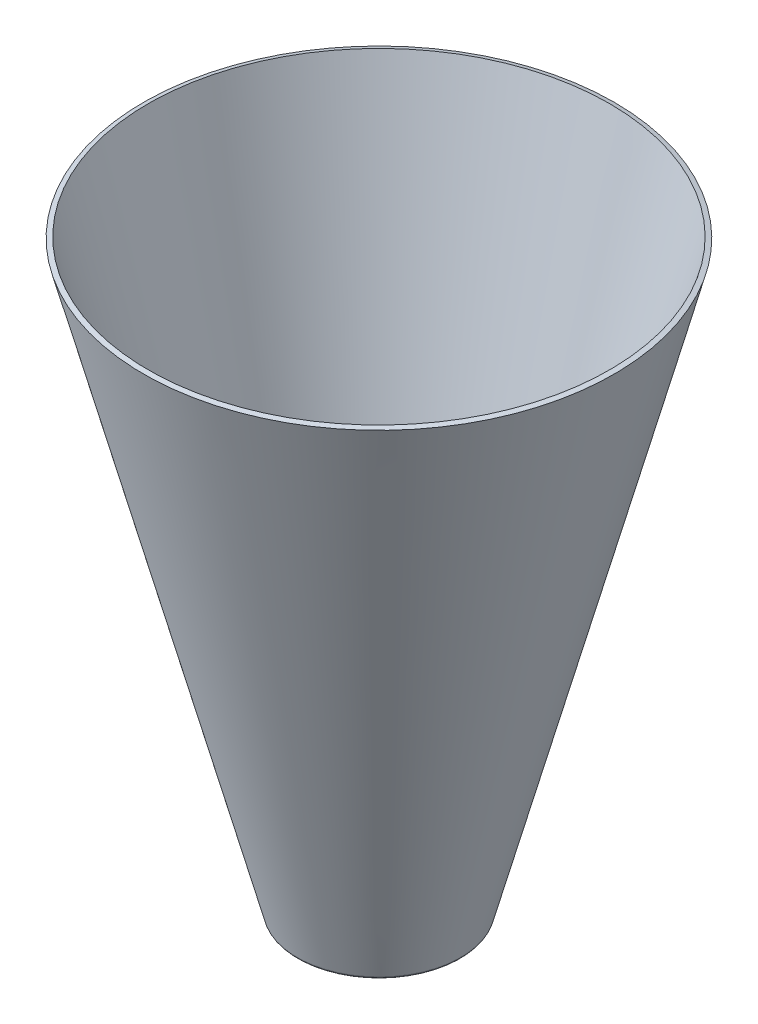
ISO-10303-21;
HEADER;
FILE_DESCRIPTION(('STEP AP214'),'2;1');
FILE_NAME('part.step','',(''),(''),'','','');
FILE_SCHEMA(('AUTOMOTIVE_DESIGN { 1 0 10303 214 1 1 1 1 }'));
ENDSEC;
DATA;
#1=APPLICATION_CONTEXT('core data for automotive mechanical design processes');
#2=APPLICATION_PROTOCOL_DEFINITION('international standard','automotive_design',2000,#1);
#3=PRODUCT_CONTEXT('',#1,'mechanical');
#4=PRODUCT('Part','Part','',(#3));
#5=PRODUCT_RELATED_PRODUCT_CATEGORY('part','',(#4));
#6=PRODUCT_DEFINITION_FORMATION('','',#4);
#7=PRODUCT_DEFINITION_CONTEXT('part definition',#1,'design');
#8=PRODUCT_DEFINITION('design','',#6,#7);
#9=PRODUCT_DEFINITION_SHAPE('','',#8);
#10=(LENGTH_UNIT() NAMED_UNIT(*) SI_UNIT(.MILLI.,.METRE.));
#11=(NAMED_UNIT(*) PLANE_ANGLE_UNIT() SI_UNIT($,.RADIAN.));
#12=(NAMED_UNIT(*) SI_UNIT($,.STERADIAN.) SOLID_ANGLE_UNIT());
#13=UNCERTAINTY_MEASURE_WITH_UNIT(LENGTH_MEASURE(1.E-05),#10,'distance_accuracy_value','');
#14=(GEOMETRIC_REPRESENTATION_CONTEXT(3) GLOBAL_UNCERTAINTY_ASSIGNED_CONTEXT((#13)) GLOBAL_UNIT_ASSIGNED_CONTEXT((#10,
#11,#12)) REPRESENTATION_CONTEXT('',''));
#15=CARTESIAN_POINT('',(0.,0.,0.));
#16=DIRECTION('',(0.,0.,1.));
#17=DIRECTION('',(1.,0.,0.));
#18=AXIS2_PLACEMENT_3D('',#15,#16,#17);
#19=CARTESIAN_POINT('',(0.,0.744845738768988,0.));
#20=DIRECTION('',(0.,1.,0.));
#21=DIRECTION('',(0.,0.,1.));
#22=AXIS2_PLACEMENT_3D('',#19,#20,#21);
#23=CONICAL_SURFACE('',#22,25.1965565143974,0.258007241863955);
#24=CARTESIAN_POINT('',(0.,180.,0.));
#25=DIRECTION('',(0.,-1.,0.));
#26=DIRECTION('',(0.,0.,-1.));
#27=AXIS2_PLACEMENT_3D('',#24,#25,#26);
#28=CIRCLE('',#27,72.5);
#29=CARTESIAN_POINT('',(0.,180.,-72.5));
#30=VERTEX_POINT('',#29);
#31=EDGE_CURVE('E10',#30,#30,#28,.T.);
#32=ORIENTED_EDGE('',*,*,#31,.T.);
#33=EDGE_LOOP('',(#32));
#34=FACE_BOUND('',#33,.T.);
#35=CARTESIAN_POINT('',(0.,0.744845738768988,0.));
#36=DIRECTION('',(0.,-1.,0.));
#37=DIRECTION('',(0.,0.,-1.));
#38=AXIS2_PLACEMENT_3D('',#35,#36,#37);
#39=CIRCLE('',#38,25.1965565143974);
#40=CARTESIAN_POINT('',(0.,0.744845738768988,-25.1965565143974));
#41=VERTEX_POINT('',#40);
#42=EDGE_CURVE('E62',#41,#41,#39,.T.);
#43=ORIENTED_EDGE('',*,*,#42,.F.);
#44=EDGE_LOOP('',(#43));
#45=FACE_BOUND('',#44,.T.);
#46=ADVANCED_FACE('F37',(#34,#45),#23,.T.);
#47=CARTESIAN_POINT('',(0.,180.382731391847,0.));
#48=DIRECTION('',(0.,-1.,0.));
#49=DIRECTION('',(0.,0.,-1.));
#50=AXIS2_PLACEMENT_3D('',#47,#48,#49);
#51=CONICAL_SURFACE('',#50,71.0496494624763,1.31278908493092);
#52=ORIENTED_EDGE('',*,*,#31,.F.);
#53=EDGE_LOOP('',(#52));
#54=FACE_BOUND('',#53,.T.);
#55=CARTESIAN_POINT('',(0.,180.382731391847,0.));
#56=DIRECTION('',(0.,-1.,0.));
#57=DIRECTION('',(0.,0.,-1.));
#58=AXIS2_PLACEMENT_3D('',#55,#56,#57);
#59=CIRCLE('',#58,71.0496494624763);
#60=CARTESIAN_POINT('',(0.,180.382731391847,-71.0496494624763));
#61=VERTEX_POINT('',#60);
#62=EDGE_CURVE('E43',#61,#61,#59,.T.);
#63=ORIENTED_EDGE('',*,*,#62,.T.);
#64=EDGE_LOOP('',(#63));
#65=FACE_BOUND('',#64,.T.);
#66=ADVANCED_FACE('F70',(#54,#65),#51,.T.);
#67=CARTESIAN_POINT('',(0.,1.5,0.));
#68=DIRECTION('',(0.,1.,0.));
#69=DIRECTION('',(0.,0.,1.));
#70=AXIS2_PLACEMENT_3D('',#67,#68,#69);
#71=CONICAL_SURFACE('',#70,23.8444842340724,0.258007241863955);
#72=ORIENTED_EDGE('',*,*,#62,.F.);
#73=EDGE_LOOP('',(#72));
#74=FACE_BOUND('',#73,.T.);
#75=CARTESIAN_POINT('',(0.,1.5,0.));
#76=DIRECTION('',(0.,-1.,0.));
#77=DIRECTION('',(0.,0.,-1.));
#78=AXIS2_PLACEMENT_3D('',#75,#76,#77);
#79=CIRCLE('',#78,23.8444842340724);
#80=CARTESIAN_POINT('',(0.,1.5,-23.8444842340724));
#81=VERTEX_POINT('',#80);
#82=EDGE_CURVE('E47',#81,#81,#79,.T.);
#83=ORIENTED_EDGE('',*,*,#82,.T.);
#84=EDGE_LOOP('',(#83));
#85=FACE_BOUND('',#84,.T.);
#86=ADVANCED_FACE('F74',(#74,#85),#71,.F.);
#87=CARTESIAN_POINT('',(24.2296561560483,1.5,0.));
#88=DIRECTION('',(0.,-1.,0.));
#89=DIRECTION('',(0.,0.,-1.));
#90=AXIS2_PLACEMENT_3D('',#87,#88,#89);
#91=PLANE('',#90);
#92=ORIENTED_EDGE('',*,*,#82,.F.);
#93=EDGE_LOOP('',(#92));
#94=FACE_BOUND('',#93,.T.);
#95=CARTESIAN_POINT('',(0.,1.5,0.));
#96=DIRECTION('',(0.,-1.,0.));
#97=DIRECTION('',(0.,0.,-1.));
#98=AXIS2_PLACEMENT_3D('',#95,#96,#97);
#99=CIRCLE('',#98,5.);
#100=CARTESIAN_POINT('',(0.,1.5,-5.));
#101=VERTEX_POINT('',#100);
#102=EDGE_CURVE('E51',#101,#101,#99,.T.);
#103=ORIENTED_EDGE('',*,*,#102,.T.);
#104=EDGE_LOOP('',(#103));
#105=FACE_BOUND('',#104,.T.);
#106=ADVANCED_FACE('F79',(#94,#105),#91,.F.);
#107=CARTESIAN_POINT('',(0.,0.,0.));
#108=DIRECTION('',(0.,-1.,0.));
#109=DIRECTION('',(0.,0.,-1.));
#110=AXIS2_PLACEMENT_3D('',#107,#108,#109);
#111=CYLINDRICAL_SURFACE('',#110,5.);
#112=ORIENTED_EDGE('',*,*,#102,.F.);
#113=EDGE_LOOP('',(#112));
#114=FACE_BOUND('',#113,.T.);
#115=CARTESIAN_POINT('',(0.,0.,0.));
#116=DIRECTION('',(0.,-1.,0.));
#117=DIRECTION('',(0.,0.,-1.));
#118=AXIS2_PLACEMENT_3D('',#115,#116,#117);
#119=CIRCLE('',#118,5.);
#120=CARTESIAN_POINT('',(0.,0.,-5.));
#121=VERTEX_POINT('',#120);
#122=EDGE_CURVE('E56',#121,#121,#119,.T.);
#123=ORIENTED_EDGE('',*,*,#122,.T.);
#124=EDGE_LOOP('',(#123));
#125=FACE_BOUND('',#124,.T.);
#126=ADVANCED_FACE('F85',(#114,#125),#111,.F.);
#127=CARTESIAN_POINT('',(24.2296561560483,0.,0.));
#128=DIRECTION('',(0.,-1.,0.));
#129=DIRECTION('',(0.,0.,-1.));
#130=AXIS2_PLACEMENT_3D('',#127,#128,#129);
#131=PLANE('',#130);
#132=CARTESIAN_POINT('',(0.,0.,0.));
#133=DIRECTION('',(0.,-1.,0.));
#134=DIRECTION('',(0.,0.,-1.));
#135=AXIS2_PLACEMENT_3D('',#132,#133,#134);
#136=CIRCLE('',#135,24.2296561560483);
#137=CARTESIAN_POINT('',(0.,0.,-24.2296561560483));
#138=VERTEX_POINT('',#137);
#139=EDGE_CURVE('E59',#138,#138,#136,.T.);
#140=ORIENTED_EDGE('',*,*,#139,.T.);
#141=EDGE_LOOP('',(#140));
#142=FACE_BOUND('',#141,.T.);
#143=ORIENTED_EDGE('',*,*,#122,.F.);
#144=EDGE_LOOP('',(#143));
#145=FACE_BOUND('',#144,.T.);
#146=ADVANCED_FACE('F89',(#142,#145),#131,.T.);
#147=CARTESIAN_POINT('',(0.,1.,0.));
#148=DIRECTION('',(0.,-1.,0.));
#149=DIRECTION('',(0.,0.,-1.));
#150=AXIS2_PLACEMENT_3D('',#147,#148,#149);
#151=TOROIDAL_SURFACE('',#150,24.2296561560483,1.);
#152=ORIENTED_EDGE('',*,*,#42,.T.);
#153=EDGE_LOOP('',(#152));
#154=FACE_BOUND('',#153,.T.);
#155=ORIENTED_EDGE('',*,*,#139,.F.);
#156=EDGE_LOOP('',(#155));
#157=FACE_BOUND('',#156,.T.);
#158=ADVANCED_FACE('F66',(#154,#157),#151,.T.);
#159=CLOSED_SHELL('',(#46,#66,#86,#106,#126,#146,#158));
#160=MANIFOLD_SOLID_BREP('B2',#159);
#161=ADVANCED_BREP_SHAPE_REPRESENTATION('',(#18,#160),#14);
#162=SHAPE_DEFINITION_REPRESENTATION(#9,#161);
ENDSEC;
END-ISO-10303-21;
